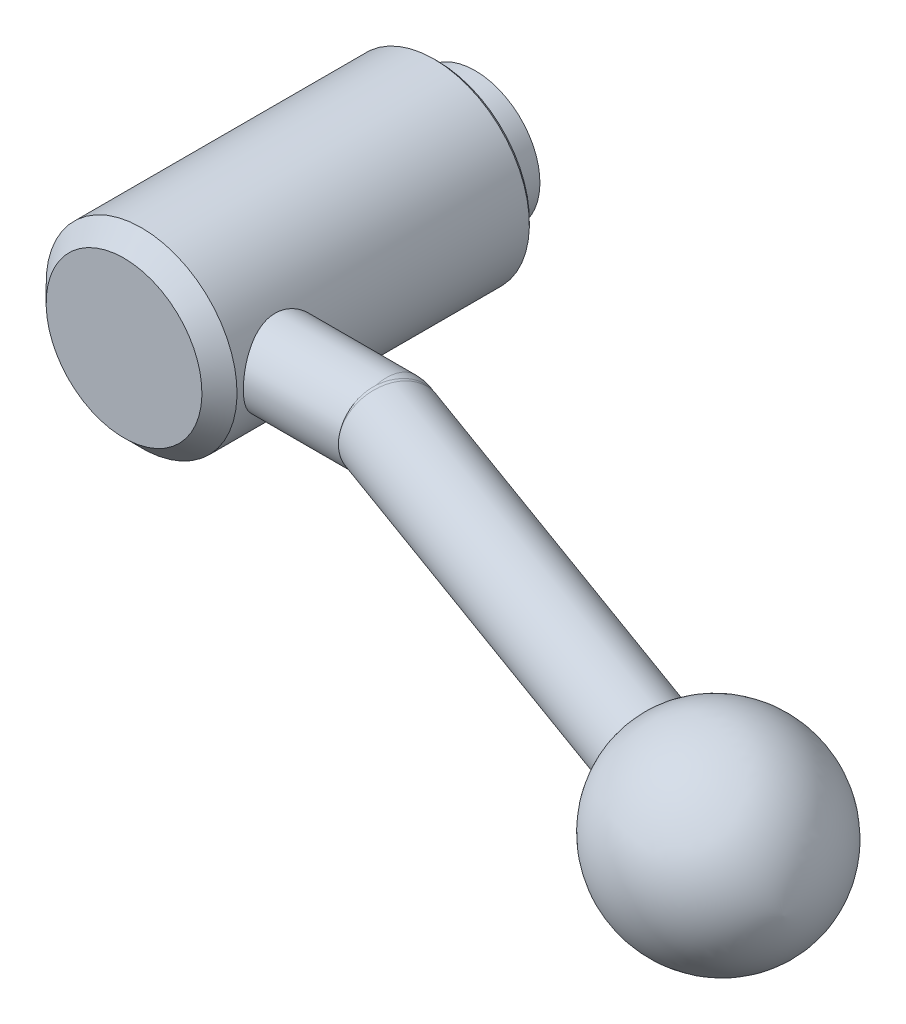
ISO-10303-21;
HEADER;
FILE_DESCRIPTION(('STEP AP214'),'2;1');
FILE_NAME('part.step','',(''),(''),'','','');
FILE_SCHEMA(('AUTOMOTIVE_DESIGN { 1 0 10303 214 1 1 1 1 }'));
ENDSEC;
DATA;
#1=APPLICATION_CONTEXT('core data for automotive mechanical design processes');
#2=APPLICATION_PROTOCOL_DEFINITION('international standard','automotive_design',2000,#1);
#3=PRODUCT_CONTEXT('',#1,'mechanical');
#4=PRODUCT('Part','Part','',(#3));
#5=PRODUCT_RELATED_PRODUCT_CATEGORY('part','',(#4));
#6=PRODUCT_DEFINITION_FORMATION('','',#4);
#7=PRODUCT_DEFINITION_CONTEXT('part definition',#1,'design');
#8=PRODUCT_DEFINITION('design','',#6,#7);
#9=PRODUCT_DEFINITION_SHAPE('','',#8);
#10=(LENGTH_UNIT() NAMED_UNIT(*) SI_UNIT(.MILLI.,.METRE.));
#11=(NAMED_UNIT(*) PLANE_ANGLE_UNIT() SI_UNIT($,.RADIAN.));
#12=(NAMED_UNIT(*) SI_UNIT($,.STERADIAN.) SOLID_ANGLE_UNIT());
#13=UNCERTAINTY_MEASURE_WITH_UNIT(LENGTH_MEASURE(1.E-05),#10,'distance_accuracy_value','');
#14=(GEOMETRIC_REPRESENTATION_CONTEXT(3) GLOBAL_UNCERTAINTY_ASSIGNED_CONTEXT((#13)) GLOBAL_UNIT_ASSIGNED_CONTEXT((#10,
#11,#12)) REPRESENTATION_CONTEXT('',''));
#15=CARTESIAN_POINT('',(0.,0.,0.));
#16=DIRECTION('',(0.,0.,1.));
#17=DIRECTION('',(1.,0.,0.));
#18=AXIS2_PLACEMENT_3D('',#15,#16,#17);
#19=CARTESIAN_POINT('',(0.,0.,0.));
#20=DIRECTION('',(0.,0.,-1.));
#21=DIRECTION('',(0.,1.,0.));
#22=AXIS2_PLACEMENT_3D('',#19,#20,#21);
#23=CYLINDRICAL_SURFACE('',#22,14.);
#24=CARTESIAN_POINT('',(0.,0.,6.05));
#25=DIRECTION('',(0.,0.,-1.));
#26=DIRECTION('',(0.,1.,0.));
#27=AXIS2_PLACEMENT_3D('',#24,#25,#26);
#28=CIRCLE('',#27,14.);
#29=CARTESIAN_POINT('',(0.,14.,6.05));
#30=VERTEX_POINT('',#29);
#31=EDGE_CURVE('E145',#30,#30,#28,.T.);
#32=ORIENTED_EDGE('',*,*,#31,.F.);
#33=EDGE_LOOP('',(#32));
#34=FACE_BOUND('',#33,.T.);
#35=CARTESIAN_POINT('',(12.6491106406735,6.,42.));
#36=CARTESIAN_POINT('',(12.6491119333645,5.99999879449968,42.1596004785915));
#37=CARTESIAN_POINT('',(12.6521417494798,5.99362272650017,42.319252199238));
#38=CARTESIAN_POINT('',(12.6641604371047,5.96818497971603,42.6373858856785));
#39=CARTESIAN_POINT('',(12.6731530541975,5.9491153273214,42.7958670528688));
#40=CARTESIAN_POINT('',(12.6968113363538,5.89845433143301,43.1107250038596));
#41=CARTESIAN_POINT('',(12.7114886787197,5.86683721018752,43.2670967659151));
#42=CARTESIAN_POINT('',(12.7460281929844,5.79141457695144,43.5763457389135));
#43=CARTESIAN_POINT('',(12.7658925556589,5.74760391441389,43.7292214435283));
#44=CARTESIAN_POINT('',(12.8100655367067,5.64846416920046,44.029718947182));
#45=CARTESIAN_POINT('',(12.834352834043,5.59319017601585,44.177362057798));
#46=CARTESIAN_POINT('',(12.8867070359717,5.47148691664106,44.467303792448));
#47=CARTESIAN_POINT('',(12.9147753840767,5.40505338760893,44.6096003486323));
#48=CARTESIAN_POINT('',(13.0034453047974,5.18984372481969,45.0271066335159));
#49=CARTESIAN_POINT('',(13.0685687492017,5.02503655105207,45.2932994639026));
#50=CARTESIAN_POINT('',(13.2082270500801,4.64606142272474,45.8109410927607));
#51=CARTESIAN_POINT('',(13.2830918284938,4.42953098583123,46.0605561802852));
#52=CARTESIAN_POINT('',(13.4311425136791,3.95794082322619,46.5214200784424));
#53=CARTESIAN_POINT('',(13.5043277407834,3.70286580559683,46.7326535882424));
#54=CARTESIAN_POINT('',(13.6088499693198,3.28949768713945,47.0208851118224));
#55=CARTESIAN_POINT('',(13.6435186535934,3.14296205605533,47.11390422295));
#56=CARTESIAN_POINT('',(13.7094062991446,2.84181000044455,47.2871776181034));
#57=CARTESIAN_POINT('',(13.7406265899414,2.68719672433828,47.3674368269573));
#58=CARTESIAN_POINT('',(13.798716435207,2.37092404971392,47.5144478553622));
#59=CARTESIAN_POINT('',(13.8255866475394,2.2092657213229,47.5812017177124));
#60=CARTESIAN_POINT('',(13.8741880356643,1.88004748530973,47.7005320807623));
#61=CARTESIAN_POINT('',(13.895919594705,1.71248801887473,47.7531096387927));
#62=CARTESIAN_POINT('',(13.9325503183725,1.38207962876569,47.8410157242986));
#63=CARTESIAN_POINT('',(13.9477579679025,1.21947370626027,47.8771298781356));
#64=CARTESIAN_POINT('',(13.9725603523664,0.891408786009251,47.9357518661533));
#65=CARTESIAN_POINT('',(13.9821554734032,0.725949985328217,47.9582606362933));
#66=CARTESIAN_POINT('',(13.9954554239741,0.393553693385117,47.9894048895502));
#67=CARTESIAN_POINT('',(13.9991623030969,0.226616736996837,47.9980452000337));
#68=CARTESIAN_POINT('',(14.0005839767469,-0.107418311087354,48.0013627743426));
#69=CARTESIAN_POINT('',(13.9982990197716,-0.274516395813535,47.996040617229));
#70=CARTESIAN_POINT('',(13.9881447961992,-0.596733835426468,47.9722942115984));
#71=CARTESIAN_POINT('',(13.9806457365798,-0.751929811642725,47.9547383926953));
#72=CARTESIAN_POINT('',(13.9606520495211,-1.06021754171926,47.9076442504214));
#73=CARTESIAN_POINT('',(13.9481558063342,-1.21330859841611,47.8781020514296));
#74=CARTESIAN_POINT('',(13.9184825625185,-1.51624558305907,47.807339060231));
#75=CARTESIAN_POINT('',(13.9013071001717,-1.66609256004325,47.7661221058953));
#76=CARTESIAN_POINT('',(13.8626834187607,-1.96169333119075,47.6723729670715));
#77=CARTESIAN_POINT('',(13.8412335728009,-2.10744554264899,47.6198364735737));
#78=CARTESIAN_POINT('',(13.7942200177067,-2.39607632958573,47.5030361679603));
#79=CARTESIAN_POINT('',(13.7685998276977,-2.53887984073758,47.4386094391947));
#80=CARTESIAN_POINT('',(13.7140859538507,-2.81854325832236,47.2990820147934));
#81=CARTESIAN_POINT('',(13.6851910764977,-2.9554009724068,47.2239774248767));
#82=CARTESIAN_POINT('',(13.5945766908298,-3.35592063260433,46.9834369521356));
#83=CARTESIAN_POINT('',(13.5288965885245,-3.60971063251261,46.8027004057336));
#84=CARTESIAN_POINT('',(13.3878711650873,-4.10313412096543,46.3903719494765));
#85=CARTESIAN_POINT('',(13.3121702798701,-4.34033236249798,46.1560074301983));
#86=CARTESIAN_POINT('',(13.1631451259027,-4.77326595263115,45.6505491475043));
#87=CARTESIAN_POINT('',(13.0898218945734,-4.96898340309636,45.3794396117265));
#88=CARTESIAN_POINT('',(12.9865629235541,-5.2305288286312,44.9447706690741));
#89=CARTESIAN_POINT('',(12.9527260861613,-5.31354333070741,44.7922272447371));
#90=CARTESIAN_POINT('',(12.8890027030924,-5.46630143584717,44.4798640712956));
#91=CARTESIAN_POINT('',(12.8591145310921,-5.53605050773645,44.3200473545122));
#92=CARTESIAN_POINT('',(12.8043472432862,-5.66157110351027,43.9942625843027));
#93=CARTESIAN_POINT('',(12.7794661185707,-5.7173482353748,43.8282970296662));
#94=CARTESIAN_POINT('',(12.7356345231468,-5.81433157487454,43.4913958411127));
#95=CARTESIAN_POINT('',(12.7166834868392,-5.85553917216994,43.3204606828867));
#96=CARTESIAN_POINT('',(12.6865220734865,-5.9205872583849,42.9866991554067));
#97=CARTESIAN_POINT('',(12.6748757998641,-5.94541170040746,42.824103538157));
#98=CARTESIAN_POINT('',(12.6578221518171,-5.98163380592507,42.4971025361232));
#99=CARTESIAN_POINT('',(12.6524143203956,-5.99303245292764,42.3326972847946));
#100=CARTESIAN_POINT('',(12.6480404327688,-6.00225784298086,42.0034733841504));
#101=CARTESIAN_POINT('',(12.6490723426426,-6.00008887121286,41.8386548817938));
#102=CARTESIAN_POINT('',(12.6575345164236,-5.98221680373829,41.5099230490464));
#103=CARTESIAN_POINT('',(12.6649645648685,-5.96651416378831,41.3460096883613));
#104=CARTESIAN_POINT('',(12.685211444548,-5.92333782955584,41.0317850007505));
#105=CARTESIAN_POINT('',(12.6976163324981,-5.89676170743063,40.8813224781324));
#106=CARTESIAN_POINT('',(12.7273370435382,-5.83233654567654,40.5832773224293));
#107=CARTESIAN_POINT('',(12.7446544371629,-5.79448390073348,40.435695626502));
#108=CARTESIAN_POINT('',(12.7836779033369,-5.70787446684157,40.1443991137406));
#109=CARTESIAN_POINT('',(12.8053831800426,-5.65911965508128,40.0006836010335));
#110=CARTESIAN_POINT('',(12.8525781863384,-5.55109972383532,39.7178468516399));
#111=CARTESIAN_POINT('',(12.8780693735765,-5.49183055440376,39.5787274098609));
#112=CARTESIAN_POINT('',(12.9333207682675,-5.36045709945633,39.2999549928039));
#113=CARTESIAN_POINT('',(12.9632176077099,-5.28790975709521,39.160537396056));
#114=CARTESIAN_POINT('',(13.0255703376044,-5.13240219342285,38.8882359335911));
#115=CARTESIAN_POINT('',(13.0580270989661,-5.04943842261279,38.7553543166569));
#116=CARTESIAN_POINT('',(13.1580121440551,-4.78560208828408,38.3674196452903));
#117=CARTESIAN_POINT('',(13.2281845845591,-4.58971750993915,38.1229353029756));
#118=CARTESIAN_POINT('',(13.3366249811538,-4.26021445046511,37.7715869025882));
#119=CARTESIAN_POINT('',(13.3748529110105,-4.13892354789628,37.6527973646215));
#120=CARTESIAN_POINT('',(13.4503551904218,-3.88654904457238,37.4257795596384));
#121=CARTESIAN_POINT('',(13.4876298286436,-3.75546845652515,37.3175480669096));
#122=CARTESIAN_POINT('',(13.5602429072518,-3.48418488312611,37.1123202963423));
#123=CARTESIAN_POINT('',(13.5955803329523,-3.34397719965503,37.0153298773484));
#124=CARTESIAN_POINT('',(13.6633349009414,-3.05536185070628,36.8333913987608));
#125=CARTESIAN_POINT('',(13.6957533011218,-2.90695776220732,36.7484381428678));
#126=CARTESIAN_POINT('',(13.7569620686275,-2.60198219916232,36.5908122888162));
#127=CARTESIAN_POINT('',(13.78573175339,-2.44537070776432,36.5182089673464));
#128=CARTESIAN_POINT('',(13.8386034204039,-2.12585519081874,36.3865716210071));
#129=CARTESIAN_POINT('',(13.862707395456,-1.96295388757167,36.3275318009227));
#130=CARTESIAN_POINT('',(13.9055467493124,-1.63205123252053,36.2236281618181));
#131=CARTESIAN_POINT('',(13.9242837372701,-1.46405142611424,36.1787600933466));
#132=CARTESIAN_POINT('',(13.9558282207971,-1.12426022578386,36.1037042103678));
#133=CARTESIAN_POINT('',(13.9686361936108,-0.952469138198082,36.0735152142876));
#134=CARTESIAN_POINT('',(13.9872197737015,-0.619242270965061,36.0298514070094));
#135=CARTESIAN_POINT('',(13.9934418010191,-0.457969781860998,36.0153142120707));
#136=CARTESIAN_POINT('',(14.0002858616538,-0.134661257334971,35.9993285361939));
#137=CARTESIAN_POINT('',(14.0009081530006,0.0273747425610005,35.99787945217));
#138=CARTESIAN_POINT('',(13.9965361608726,0.350926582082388,36.008085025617));
#139=CARTESIAN_POINT('',(13.991542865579,0.512442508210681,36.0197373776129));
#140=CARTESIAN_POINT('',(13.976077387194,0.833743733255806,36.0560107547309));
#141=CARTESIAN_POINT('',(13.9656052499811,0.993529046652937,36.0806316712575));
#142=CARTESIAN_POINT('',(13.9399800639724,1.30393627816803,36.1413509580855));
#143=CARTESIAN_POINT('',(13.9250277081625,1.45467118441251,36.176958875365));
#144=CARTESIAN_POINT('',(13.89068609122,1.75251852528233,36.2595669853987));
#145=CARTESIAN_POINT('',(13.8712953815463,1.89962975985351,36.3065708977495));
#146=CARTESIAN_POINT('',(13.8285434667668,2.18924878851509,36.4115377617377));
#147=CARTESIAN_POINT('',(13.8051831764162,2.33175763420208,36.4694981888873));
#148=CARTESIAN_POINT('',(13.7550167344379,2.61145800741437,36.5959410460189));
#149=CARTESIAN_POINT('',(13.7282092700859,2.74864748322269,36.6644274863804));
#150=CARTESIAN_POINT('',(13.6704759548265,3.02301487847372,36.8147378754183));
#151=CARTESIAN_POINT('',(13.639418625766,3.1599112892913,36.8970251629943));
#152=CARTESIAN_POINT('',(13.5749315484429,3.42637329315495,37.0719801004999));
#153=CARTESIAN_POINT('',(13.5415009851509,3.55593634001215,37.1646513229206));
#154=CARTESIAN_POINT('',(13.4730570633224,3.80705581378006,37.3597829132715));
#155=CARTESIAN_POINT('',(13.4380434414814,3.9286109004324,37.4622449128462));
#156=CARTESIAN_POINT('',(13.3672591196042,4.16309810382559,37.6763643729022));
#157=CARTESIAN_POINT('',(13.3314883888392,4.27602986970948,37.7880222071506));
#158=CARTESIAN_POINT('',(13.257431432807,4.50061025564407,38.02841367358));
#159=CARTESIAN_POINT('',(13.2191519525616,4.61156500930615,38.1577987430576));
#160=CARTESIAN_POINT('',(13.1437838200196,4.82218384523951,38.4257073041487));
#161=CARTESIAN_POINT('',(13.1066947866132,4.92185156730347,38.5642278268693));
#162=CARTESIAN_POINT('',(13.0347422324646,5.10936324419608,38.8498227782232));
#163=CARTESIAN_POINT('',(12.9998810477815,5.19719489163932,38.9969058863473));
#164=CARTESIAN_POINT('',(12.9335248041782,5.36019403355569,39.2985749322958));
#165=CARTESIAN_POINT('',(12.9020282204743,5.43536727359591,39.4531574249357));
#166=CARTESIAN_POINT('',(12.8434648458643,5.57233851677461,39.7687244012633));
#167=CARTESIAN_POINT('',(12.8163926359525,5.63415291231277,39.9297007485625));
#168=CARTESIAN_POINT('',(12.7676047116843,5.74385568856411,40.2570433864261));
#169=CARTESIAN_POINT('',(12.7458863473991,5.79175096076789,40.4234069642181));
#170=CARTESIAN_POINT('',(12.7086612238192,5.87298255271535,40.7598587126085));
#171=CARTESIAN_POINT('',(12.6931381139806,5.90635721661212,40.9299358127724));
#172=CARTESIAN_POINT('',(12.6688496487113,5.95827833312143,41.2727263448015));
#173=CARTESIAN_POINT('',(12.6600791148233,5.97683614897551,41.4454376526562));
#174=CARTESIAN_POINT('',(12.6529445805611,5.99191158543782,41.6821226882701));
#175=CARTESIAN_POINT('',(12.6515079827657,5.99494373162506,41.7456483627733));
#176=CARTESIAN_POINT('',(12.6495907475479,5.998988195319,41.8727799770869));
#177=CARTESIAN_POINT('',(12.6491101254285,6.00000048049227,41.936385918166));
#178=CARTESIAN_POINT('',(12.6491106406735,6.,42.));
#179=B_SPLINE_CURVE_WITH_KNOTS('',3,(#35,#36,#37,#38,#39,#40,#41,#42,#43,#44,#45,#46,#47,#48,
#49,#50,#51,#52,#53,#54,#55,#56,#57,#58,#59,#60,#61,#62,#63,#64,#65,#66,#67,#68,#69,#70,#71,#72,
#73,#74,#75,#76,#77,#78,#79,#80,#81,#82,#83,#84,#85,#86,#87,#88,#89,#90,#91,#92,#93,#94,#95,#96,
#97,#98,#99,#100,#101,#102,#103,#104,#105,#106,#107,#108,#109,#110,#111,#112,#113,#114,#115,
#116,#117,#118,#119,#120,#121,#122,#123,#124,#125,#126,#127,#128,#129,#130,#131,#132,#133,#134,
#135,#136,#137,#138,#139,#140,#141,#142,#143,#144,#145,#146,#147,#148,#149,#150,#151,#152,#153,
#154,#155,#156,#157,#158,#159,#160,#161,#162,#163,#164,#165,#166,#167,#168,#169,#170,#171,#172,
#173,#174,#175,#176,#177,#178),.UNSPECIFIED.,.T.,.F.,(4,2,2,2,2,2,2,2,2,2,2,2,2,2,2,2,2,2,2,2,2,
2,2,2,2,2,2,2,2,2,2,2,2,2,2,2,2,2,2,2,2,2,2,2,2,2,2,2,2,2,2,2,2,2,2,2,2,2,2,2,2,2,2,2,2,2,2,2,2,
2,2,4),(0.,0.478735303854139,0.957771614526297,1.43779720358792,1.91802586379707,
2.39599804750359,2.87415322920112,3.82930565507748,4.84157827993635,5.85425356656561,
6.38467511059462,6.91489143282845,7.44502749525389,7.97512400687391,8.47625092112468,
8.9773433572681,9.47826133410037,9.97915853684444,10.4477041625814,10.9164014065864,
11.3849447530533,11.8536667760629,12.3293655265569,12.8052382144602,13.756394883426,
14.7778987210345,15.7998424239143,16.330075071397,16.8600886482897,17.3898891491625,
17.9196391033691,18.4136567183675,18.9076381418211,19.4014635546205,19.8952723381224,
20.354632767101,20.814140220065,21.2735644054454,21.7331659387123,22.2125740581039,
22.6921459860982,23.6508169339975,24.1724207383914,24.6938646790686,25.2155791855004,
25.7370677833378,26.2613915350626,26.7854908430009,27.3094328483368,27.8333326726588,
28.3188546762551,28.8043543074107,29.2897685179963,29.7751786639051,30.2414628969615,
30.7078995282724,31.1742288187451,31.6407362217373,32.1283561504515,32.6161443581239,
33.1040139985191,33.5919034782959,34.1153644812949,34.6386561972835,35.1624879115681,
35.6860812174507,36.2090283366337,36.7317160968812,37.253015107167,37.7739139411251,
37.9647267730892,38.1555426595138),.UNSPECIFIED.);
#180=CARTESIAN_POINT('',(12.6491106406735,6.,42.));
#181=VERTEX_POINT('',#180);
#182=EDGE_CURVE('E22',#181,#181,#179,.T.);
#183=ORIENTED_EDGE('',*,*,#182,.F.);
#184=EDGE_LOOP('',(#183));
#185=FACE_BOUND('',#184,.T.);
#186=CARTESIAN_POINT('',(0.,0.,48.925));
#187=DIRECTION('',(0.,0.,-1.));
#188=DIRECTION('',(0.,1.,0.));
#189=AXIS2_PLACEMENT_3D('',#186,#187,#188);
#190=CIRCLE('',#189,14.);
#191=CARTESIAN_POINT('',(0.,14.,48.925));
#192=VERTEX_POINT('',#191);
#193=EDGE_CURVE('E147',#192,#192,#190,.T.);
#194=ORIENTED_EDGE('',*,*,#193,.T.);
#195=EDGE_LOOP('',(#194));
#196=FACE_BOUND('',#195,.T.);
#197=ADVANCED_FACE('F14',(#34,#185,#196),#23,.T.);
#198=CARTESIAN_POINT('',(0.,0.,51.5));
#199=DIRECTION('',(0.,0.,-1.));
#200=DIRECTION('',(0.,1.,0.));
#201=AXIS2_PLACEMENT_3D('',#198,#199,#200);
#202=PLANE('',#201);
#203=CARTESIAN_POINT('',(0.,0.,51.5));
#204=DIRECTION('',(0.,0.,-1.));
#205=DIRECTION('',(0.,1.,0.));
#206=AXIS2_PLACEMENT_3D('',#203,#204,#205);
#207=CIRCLE('',#206,11.425);
#208=CARTESIAN_POINT('',(0.,11.425,51.5));
#209=VERTEX_POINT('',#208);
#210=EDGE_CURVE('E78',#209,#209,#207,.T.);
#211=ORIENTED_EDGE('',*,*,#210,.F.);
#212=EDGE_LOOP('',(#211));
#213=FACE_BOUND('',#212,.T.);
#214=ADVANCED_FACE('F16',(#213),#202,.F.);
#215=CARTESIAN_POINT('',(0.,0.,51.5));
#216=DIRECTION('',(0.,0.,-1.));
#217=DIRECTION('',(0.,1.,0.));
#218=AXIS2_PLACEMENT_3D('',#215,#216,#217);
#219=CONICAL_SURFACE('',#218,11.425,0.785398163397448);
#220=ORIENTED_EDGE('',*,*,#193,.F.);
#221=EDGE_LOOP('',(#220));
#222=FACE_BOUND('',#221,.T.);
#223=ORIENTED_EDGE('',*,*,#210,.T.);
#224=EDGE_LOOP('',(#223));
#225=FACE_BOUND('',#224,.T.);
#226=ADVANCED_FACE('F64',(#222,#225),#219,.T.);
#227=CARTESIAN_POINT('',(0.,0.,6.05));
#228=DIRECTION('',(0.,0.,1.));
#229=DIRECTION('',(0.,-1.,0.));
#230=AXIS2_PLACEMENT_3D('',#227,#228,#229);
#231=CONICAL_SURFACE('',#230,14.,0.785398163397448);
#232=CARTESIAN_POINT('',(0.,0.,5.5));
#233=DIRECTION('',(0.,0.,-1.));
#234=DIRECTION('',(0.,1.,0.));
#235=AXIS2_PLACEMENT_3D('',#232,#233,#234);
#236=CIRCLE('',#235,13.45);
#237=CARTESIAN_POINT('',(0.,13.45,5.5));
#238=VERTEX_POINT('',#237);
#239=EDGE_CURVE('E140',#238,#238,#236,.T.);
#240=ORIENTED_EDGE('',*,*,#239,.F.);
#241=EDGE_LOOP('',(#240));
#242=FACE_BOUND('',#241,.T.);
#243=ORIENTED_EDGE('',*,*,#31,.T.);
#244=EDGE_LOOP('',(#243));
#245=FACE_BOUND('',#244,.T.);
#246=ADVANCED_FACE('F70',(#242,#245),#231,.T.);
#247=CARTESIAN_POINT('',(13.45,0.,5.5));
#248=DIRECTION('',(0.,0.,1.));
#249=DIRECTION('',(0.,-1.,0.));
#250=AXIS2_PLACEMENT_3D('',#247,#248,#249);
#251=PLANE('',#250);
#252=CARTESIAN_POINT('',(0.,0.,5.5));
#253=DIRECTION('',(0.,0.,-1.));
#254=DIRECTION('',(0.,1.,0.));
#255=AXIS2_PLACEMENT_3D('',#252,#253,#254);
#256=CIRCLE('',#255,9.5);
#257=CARTESIAN_POINT('',(0.,9.5,5.5));
#258=VERTEX_POINT('',#257);
#259=EDGE_CURVE('E138',#258,#258,#256,.T.);
#260=ORIENTED_EDGE('',*,*,#259,.F.);
#261=EDGE_LOOP('',(#260));
#262=FACE_BOUND('',#261,.T.);
#263=ORIENTED_EDGE('',*,*,#239,.T.);
#264=EDGE_LOOP('',(#263));
#265=FACE_BOUND('',#264,.T.);
#266=ADVANCED_FACE('F159',(#262,#265),#251,.F.);
#267=CARTESIAN_POINT('',(0.,0.,0.));
#268=DIRECTION('',(0.,0.,-1.));
#269=DIRECTION('',(0.,1.,0.));
#270=AXIS2_PLACEMENT_3D('',#267,#268,#269);
#271=CYLINDRICAL_SURFACE('',#270,9.5);
#272=CARTESIAN_POINT('',(0.,0.,0.));
#273=DIRECTION('',(0.,0.,-1.));
#274=DIRECTION('',(0.,1.,0.));
#275=AXIS2_PLACEMENT_3D('',#272,#273,#274);
#276=CIRCLE('',#275,9.5);
#277=CARTESIAN_POINT('',(0.,9.5,0.));
#278=VERTEX_POINT('',#277);
#279=EDGE_CURVE('E136',#278,#278,#276,.T.);
#280=ORIENTED_EDGE('',*,*,#279,.F.);
#281=EDGE_LOOP('',(#280));
#282=FACE_BOUND('',#281,.T.);
#283=ORIENTED_EDGE('',*,*,#259,.T.);
#284=EDGE_LOOP('',(#283));
#285=FACE_BOUND('',#284,.T.);
#286=ADVANCED_FACE('F133',(#282,#285),#271,.T.);
#287=CARTESIAN_POINT('',(9.5,0.,0.));
#288=DIRECTION('',(0.,0.,1.));
#289=DIRECTION('',(0.,-1.,0.));
#290=AXIS2_PLACEMENT_3D('',#287,#288,#289);
#291=PLANE('',#290);
#292=CARTESIAN_POINT('',(0.,0.,0.));
#293=DIRECTION('',(0.,0.,-1.));
#294=DIRECTION('',(0.,1.,0.));
#295=AXIS2_PLACEMENT_3D('',#292,#293,#294);
#296=CIRCLE('',#295,6.);
#297=CARTESIAN_POINT('',(0.,6.,0.));
#298=VERTEX_POINT('',#297);
#299=EDGE_CURVE('E122',#298,#298,#296,.T.);
#300=ORIENTED_EDGE('',*,*,#299,.F.);
#301=EDGE_LOOP('',(#300));
#302=FACE_BOUND('',#301,.T.);
#303=ORIENTED_EDGE('',*,*,#279,.T.);
#304=EDGE_LOOP('',(#303));
#305=FACE_BOUND('',#304,.T.);
#306=ADVANCED_FACE('F86',(#302,#305),#291,.F.);
#307=CARTESIAN_POINT('',(35.,0.,42.));
#308=DIRECTION('',(1.,0.,0.));
#309=DIRECTION('',(0.,1.,0.));
#310=AXIS2_PLACEMENT_3D('',#307,#308,#309);
#311=CYLINDRICAL_SURFACE('',#310,6.);
#312=CARTESIAN_POINT('',(29.0002,-5.79737991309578,43.546087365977));
#313=CARTESIAN_POINT('',(28.9724990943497,-5.77707543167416,43.6222362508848));
#314=CARTESIAN_POINT('',(28.9459271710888,-5.75516638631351,43.6983487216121));
#315=CARTESIAN_POINT('',(28.894739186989,-5.70814835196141,43.8502306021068));
#316=CARTESIAN_POINT('',(28.8701228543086,-5.68303980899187,43.9260000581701));
#317=CARTESIAN_POINT('',(28.7987695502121,-5.6029491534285,44.1523368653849));
#318=CARTESIAN_POINT('',(28.7544982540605,-5.54317949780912,44.3020176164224));
#319=CARTESIAN_POINT('',(28.6711793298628,-5.41121602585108,44.5970862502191));
#320=CARTESIAN_POINT('',(28.6321268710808,-5.3390338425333,44.7424780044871));
#321=CARTESIAN_POINT('',(28.5583361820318,-5.18257721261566,45.0277646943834));
#322=CARTESIAN_POINT('',(28.5235982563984,-5.09830191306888,45.1676592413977));
#323=CARTESIAN_POINT('',(28.4579073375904,-4.91822874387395,45.4406017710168));
#324=CARTESIAN_POINT('',(28.4269515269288,-4.82243955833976,45.5736548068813));
#325=CARTESIAN_POINT('',(28.3684157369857,-4.61988344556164,45.8319198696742));
#326=CARTESIAN_POINT('',(28.3408357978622,-4.5131163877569,45.9571318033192));
#327=CARTESIAN_POINT('',(28.2887910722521,-4.28931411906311,46.1986769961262));
#328=CARTESIAN_POINT('',(28.264325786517,-4.17228055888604,46.3150116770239));
#329=CARTESIAN_POINT('',(28.2183149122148,-3.92870690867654,46.537897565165));
#330=CARTESIAN_POINT('',(28.1967693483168,-3.8021667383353,46.6444486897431));
#331=CARTESIAN_POINT('',(28.1562496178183,-3.53907309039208,46.8479799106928));
#332=CARTESIAN_POINT('',(28.1373045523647,-3.40242909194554,46.944848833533));
#333=CARTESIAN_POINT('',(28.1021430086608,-3.12121919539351,47.1269937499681));
#334=CARTESIAN_POINT('',(28.0859274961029,-2.97665051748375,47.212265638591));
#335=CARTESIAN_POINT('',(28.0561585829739,-2.68068805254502,47.3704807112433));
#336=CARTESIAN_POINT('',(28.0426047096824,-2.52929548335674,47.4434260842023));
#337=CARTESIAN_POINT('',(28.0180943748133,-2.2206886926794,47.5764491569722));
#338=CARTESIAN_POINT('',(28.0071388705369,-2.063472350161,47.6365221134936));
#339=CARTESIAN_POINT('',(27.987872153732,-1.74574860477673,47.7428380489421));
#340=CARTESIAN_POINT('',(27.97953948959,-1.5852799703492,47.7891930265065));
#341=CARTESIAN_POINT('',(27.965363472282,-1.26087148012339,47.8683977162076));
#342=CARTESIAN_POINT('',(27.9595210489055,-1.09693035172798,47.9012423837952));
#343=CARTESIAN_POINT('',(27.950314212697,-0.766902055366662,47.9531293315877));
#344=CARTESIAN_POINT('',(27.9469484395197,-0.600816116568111,47.972179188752));
#345=CARTESIAN_POINT('',(27.9426785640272,-0.267526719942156,47.9963621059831));
#346=CARTESIAN_POINT('',(27.9417755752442,-0.100322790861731,48.0014888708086));
#347=CARTESIAN_POINT('',(27.9424301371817,0.233076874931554,47.9977768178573));
#348=CARTESIAN_POINT('',(27.943975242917,0.399273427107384,47.9890086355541));
#349=CARTESIAN_POINT('',(27.9495060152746,0.730248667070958,47.9577139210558));
#350=CARTESIAN_POINT('',(27.9534905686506,0.895027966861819,47.9351936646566));
#351=CARTESIAN_POINT('',(27.9639138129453,1.22215531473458,47.8765604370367));
#352=CARTESIAN_POINT('',(27.9703537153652,1.38450212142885,47.8404407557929));
#353=CARTESIAN_POINT('',(27.9857050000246,1.70547020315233,47.7549062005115));
#354=CARTESIAN_POINT('',(27.9946154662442,1.86409283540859,47.7054962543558));
#355=CARTESIAN_POINT('',(28.0149428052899,2.17661167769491,47.5937385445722));
#356=CARTESIAN_POINT('',(28.0263605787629,2.33050616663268,47.5313861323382));
#357=CARTESIAN_POINT('',(28.0517386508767,2.63237333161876,47.3942638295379));
#358=CARTESIAN_POINT('',(28.0656980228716,2.78034814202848,47.3194984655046));
#359=CARTESIAN_POINT('',(28.0962237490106,3.06943625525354,47.1580977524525));
#360=CARTESIAN_POINT('',(28.1127906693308,3.21054805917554,47.0714598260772));
#361=CARTESIAN_POINT('',(28.1486024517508,3.48485557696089,46.8870325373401));
#362=CARTESIAN_POINT('',(28.1678464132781,3.61805393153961,46.789246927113));
#363=CARTESIAN_POINT('',(28.2092310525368,3.87634885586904,46.5827287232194));
#364=CARTESIAN_POINT('',(28.2313862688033,4.00139970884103,46.4739418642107));
#365=CARTESIAN_POINT('',(28.2786635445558,4.24179144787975,46.2467117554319));
#366=CARTESIAN_POINT('',(28.303785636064,4.35713222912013,46.128268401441));
#367=CARTESIAN_POINT('',(28.3572036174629,4.57734862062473,45.8826648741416));
#368=CARTESIAN_POINT('',(28.38549985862,4.68222307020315,45.7555037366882));
#369=CARTESIAN_POINT('',(28.445549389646,4.88081288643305,45.4935198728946));
#370=CARTESIAN_POINT('',(28.4773025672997,4.97452861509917,45.3586973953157));
#371=CARTESIAN_POINT('',(28.5429262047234,5.14565563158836,45.0897088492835));
#372=CARTESIAN_POINT('',(28.5766009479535,5.22366104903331,44.9558726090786));
#373=CARTESIAN_POINT('',(28.647938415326,5.36870734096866,44.6834298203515));
#374=CARTESIAN_POINT('',(28.6856006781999,5.43574948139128,44.5448238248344));
#375=CARTESIAN_POINT('',(28.7657142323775,5.55859867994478,44.2639502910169));
#376=CARTESIAN_POINT('',(28.8081677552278,5.61440046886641,44.1216810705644));
#377=CARTESIAN_POINT('',(28.8763731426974,5.68948565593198,43.9067054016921));
#378=CARTESIAN_POINT('',(28.8998696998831,5.7130832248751,43.8347644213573));
#379=CARTESIAN_POINT('',(28.9486375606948,5.7573957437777,43.6905883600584));
#380=CARTESIAN_POINT('',(28.9739090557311,5.77811038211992,43.6183532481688));
#381=CARTESIAN_POINT('',(29.0001999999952,5.79737991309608,43.546087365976));
#382=B_SPLINE_CURVE_WITH_KNOTS('',3,(#312,#313,#314,#315,#316,#317,#318,#319,#320,#321,#322,
#323,#324,#325,#326,#327,#328,#329,#330,#331,#332,#333,#334,#335,#336,#337,#338,#339,#340,#341,
#342,#343,#344,#345,#346,#347,#348,#349,#350,#351,#352,#353,#354,#355,#356,#357,#358,#359,#360,
#361,#362,#363,#364,#365,#366,#367,#368,#369,#370,#371,#372,#373,#374,#375,#376,#377,#378,#379,
#380,#381),.UNSPECIFIED.,.F.,.F.,(4,2,2,2,2,2,2,2,2,2,2,2,2,2,2,2,2,2,2,2,2,2,2,2,2,2,2,2,2,2,2,
2,2,2,4),(0.,0.250554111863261,0.501073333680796,1.00183412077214,1.50212812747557,
2.0024574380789,2.50241172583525,3.00237196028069,3.50225195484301,4.00213617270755,
4.50722386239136,5.01248987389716,5.51766606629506,6.02302808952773,6.52414248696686,
7.02544382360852,7.52646960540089,8.02772188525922,8.52643419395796,9.02491908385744,
9.52365025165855,10.0221967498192,10.5209226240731,11.0194670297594,11.5181198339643,
12.0166052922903,12.5176821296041,13.0187643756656,13.5199021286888,14.0210236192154,
14.4961092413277,14.9711399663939,15.4463928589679,15.684153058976,15.9219389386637),.UNSPECIFIED.);
#383=CARTESIAN_POINT('',(29.,-5.79723335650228,43.5466368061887));
#384=VERTEX_POINT('',#383);
#385=CARTESIAN_POINT('',(27.9420381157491,0.,48.));
#386=VERTEX_POINT('',#385);
#387=EDGE_CURVE('E29',#384,#386,#382,.T.);
#388=ORIENTED_EDGE('',*,*,#387,.T.);
#389=CARTESIAN_POINT('',(29.,5.79723335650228,43.5466368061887));
#390=VERTEX_POINT('',#389);
#391=EDGE_CURVE('E91',#386,#390,#382,.T.);
#392=ORIENTED_EDGE('',*,*,#391,.T.);
#393=CARTESIAN_POINT('',(29.,0.,42.));
#394=DIRECTION('',(1.,0.,0.));
#395=DIRECTION('',(0.,1.,0.));
#396=AXIS2_PLACEMENT_3D('',#393,#394,#395);
#397=CIRCLE('',#396,6.);
#398=EDGE_CURVE('E100',#384,#390,#397,.T.);
#399=ORIENTED_EDGE('',*,*,#398,.F.);
#400=EDGE_LOOP('',(#388,#392,#399));
#401=FACE_BOUND('',#400,.T.);
#402=ORIENTED_EDGE('',*,*,#182,.T.);
#403=EDGE_LOOP('',(#402));
#404=FACE_BOUND('',#403,.T.);
#405=ADVANCED_FACE('F80',(#401,#404),#311,.T.);
#406=CARTESIAN_POINT('',(29.,0.,42.));
#407=DIRECTION('',(1.,0.,0.));
#408=DIRECTION('',(0.,0.,1.));
#409=AXIS2_PLACEMENT_3D('',#406,#407,#408);
#410=SPHERICAL_SURFACE('',#409,6.);
#411=CARTESIAN_POINT('',(29.4970794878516,0.,42.1809221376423));
#412=DIRECTION('',(0.939692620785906,0.,0.342020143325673));
#413=DIRECTION('',(-0.342020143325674,0.,0.939692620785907));
#414=AXIS2_PLACEMENT_3D('',#411,#412,#413);
#415=CIRCLE('',#414,5.97663610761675);
#416=EDGE_CURVE('E9',#384,#390,#415,.T.);
#417=ORIENTED_EDGE('',*,*,#416,.F.);
#418=ORIENTED_EDGE('',*,*,#398,.T.);
#419=EDGE_LOOP('',(#417,#418));
#420=FACE_BOUND('',#419,.T.);
#421=ADVANCED_FACE('F85',(#420),#410,.T.);
#422=CARTESIAN_POINT('',(29.9941589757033,0.,42.3618442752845));
#423=DIRECTION('',(0.939692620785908,0.,0.342020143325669));
#424=DIRECTION('',(-0.342020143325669,0.,0.939692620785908));
#425=AXIS2_PLACEMENT_3D('',#422,#423,#424);
#426=SPHERICAL_SURFACE('',#425,6.);
#427=ORIENTED_EDGE('',*,*,#387,.F.);
#428=ORIENTED_EDGE('',*,*,#416,.T.);
#429=ORIENTED_EDGE('',*,*,#391,.F.);
#430=CARTESIAN_POINT('',(29.9941589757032,0.,42.3618442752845));
#431=DIRECTION('',(0.939692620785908,0.,0.342020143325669));
#432=DIRECTION('',(-0.342020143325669,0.,0.939692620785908));
#433=AXIS2_PLACEMENT_3D('',#430,#431,#432);
#434=CIRCLE('',#433,6.);
#435=EDGE_CURVE('E98',#386,#386,#434,.T.);
#436=ORIENTED_EDGE('',*,*,#435,.F.);
#437=EDGE_LOOP('',(#427,#428,#429,#436));
#438=FACE_BOUND('',#437,.T.);
#439=ADVANCED_FACE('F102',(#438),#426,.T.);
#440=CARTESIAN_POINT('',(120.484247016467,0.,75.2975428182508));
#441=DIRECTION('',(0.939692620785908,0.,0.342020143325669));
#442=DIRECTION('',(-0.342020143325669,0.,0.939692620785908));
#443=AXIS2_PLACEMENT_3D('',#440,#441,#442);
#444=CYLINDRICAL_SURFACE('',#443,6.);
#445=CARTESIAN_POINT('',(93.4815813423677,0.,65.4693762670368));
#446=DIRECTION('',(0.939692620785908,0.,0.342020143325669));
#447=DIRECTION('',(-0.342020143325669,0.,0.939692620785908));
#448=AXIS2_PLACEMENT_3D('',#445,#446,#447);
#449=CIRCLE('',#448,6.);
#450=CARTESIAN_POINT('',(91.4294604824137,0.,71.1075319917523));
#451=VERTEX_POINT('',#450);
#452=EDGE_CURVE('E114',#451,#451,#449,.T.);
#453=ORIENTED_EDGE('',*,*,#452,.F.);
#454=EDGE_LOOP('',(#453));
#455=FACE_BOUND('',#454,.T.);
#456=ORIENTED_EDGE('',*,*,#435,.T.);
#457=EDGE_LOOP('',(#456));
#458=FACE_BOUND('',#457,.T.);
#459=ADVANCED_FACE('F54',(#455,#458),#444,.T.);
#460=CARTESIAN_POINT('',(91.4294604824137,0.,71.1075319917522));
#461=DIRECTION('',(0.939692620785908,0.,0.342020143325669));
#462=DIRECTION('',(-0.342020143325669,0.,0.939692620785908));
#463=AXIS2_PLACEMENT_3D('',#460,#461,#462);
#464=PLANE('',#463);
#465=CARTESIAN_POINT('',(93.4815813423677,0.,65.4693762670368));
#466=DIRECTION('',(0.939692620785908,0.,0.342020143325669));
#467=DIRECTION('',(-0.342020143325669,0.,0.939692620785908));
#468=AXIS2_PLACEMENT_3D('',#465,#466,#467);
#469=CIRCLE('',#468,8.16630341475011);
#470=CARTESIAN_POINT('',(90.688541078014,0.,73.1431913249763));
#471=VERTEX_POINT('',#470);
#472=EDGE_CURVE('E117',#471,#471,#469,.T.);
#473=ORIENTED_EDGE('',*,*,#472,.F.);
#474=EDGE_LOOP('',(#473));
#475=FACE_BOUND('',#474,.T.);
#476=ORIENTED_EDGE('',*,*,#452,.T.);
#477=EDGE_LOOP('',(#476));
#478=FACE_BOUND('',#477,.T.);
#479=ADVANCED_FACE('F43',(#475,#478),#464,.F.);
#480=CARTESIAN_POINT('',(106.,0.,68.5));
#481=DIRECTION('',(0.,0.999999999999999,0.));
#482=DIRECTION('',(-0.342020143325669,0.,0.939692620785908));
#483=AXIS2_PLACEMENT_3D('',#480,#481,#482);
#484=CIRCLE('',#483,16.);
#485=TRIMMED_CURVE('',#484,(PARAMETER_VALUE(-1.48106994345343)),
(PARAMETER_VALUE(1.48106994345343)),.T.,.PARAMETER.);
#486=CARTESIAN_POINT('',(105.509646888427,0.,69.8472341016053));
#487=DIRECTION('',(0.939692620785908,0.,0.342020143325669));
#488=AXIS1_PLACEMENT('',#486,#487);
#489=SURFACE_OF_REVOLUTION('',#485,#488);
#490=ORIENTED_EDGE('',*,*,#472,.T.);
#491=EDGE_LOOP('',(#490));
#492=FACE_BOUND('',#491,.T.);
#493=CARTESIAN_POINT('',(120.484247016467,0.,75.2975428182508));
#494=VERTEX_POINT('',#493);
#495=VERTEX_LOOP('',#494);
#496=FACE_BOUND('',#495,.T.);
#497=ADVANCED_FACE('F40',(#492,#496),#489,.T.);
#498=CARTESIAN_POINT('',(0.,0.,17.));
#499=DIRECTION('',(0.,0.,-1.));
#500=DIRECTION('',(0.,1.,0.));
#501=AXIS2_PLACEMENT_3D('',#498,#499,#500);
#502=CYLINDRICAL_SURFACE('',#501,6.);
#503=CARTESIAN_POINT('',(0.,0.,17.));
#504=DIRECTION('',(0.,0.,-1.));
#505=DIRECTION('',(0.,1.,0.));
#506=AXIS2_PLACEMENT_3D('',#503,#504,#505);
#507=CIRCLE('',#506,6.);
#508=CARTESIAN_POINT('',(0.,6.,17.));
#509=VERTEX_POINT('',#508);
#510=EDGE_CURVE('E119',#509,#509,#507,.T.);
#511=ORIENTED_EDGE('',*,*,#510,.F.);
#512=EDGE_LOOP('',(#511));
#513=FACE_BOUND('',#512,.T.);
#514=ORIENTED_EDGE('',*,*,#299,.T.);
#515=EDGE_LOOP('',(#514));
#516=FACE_BOUND('',#515,.T.);
#517=ADVANCED_FACE('F42',(#513,#516),#502,.F.);
#518=CARTESIAN_POINT('',(0.,0.,17.));
#519=DIRECTION('',(0.,0.,-1.));
#520=DIRECTION('',(0.,1.,0.));
#521=AXIS2_PLACEMENT_3D('',#518,#519,#520);
#522=PLANE('',#521);
#523=ORIENTED_EDGE('',*,*,#510,.T.);
#524=EDGE_LOOP('',(#523));
#525=FACE_BOUND('',#524,.T.);
#526=ADVANCED_FACE('F51',(#525),#522,.T.);
#527=CLOSED_SHELL('',(#197,#214,#226,#246,#266,#286,#306,#405,#421,#439,#459,#479,#497,#517,#526));
#528=MANIFOLD_SOLID_BREP('B1',#527);
#529=ADVANCED_BREP_SHAPE_REPRESENTATION('',(#18,#528),#14);
#530=SHAPE_DEFINITION_REPRESENTATION(#9,#529);
ENDSEC;
END-ISO-10303-21;
